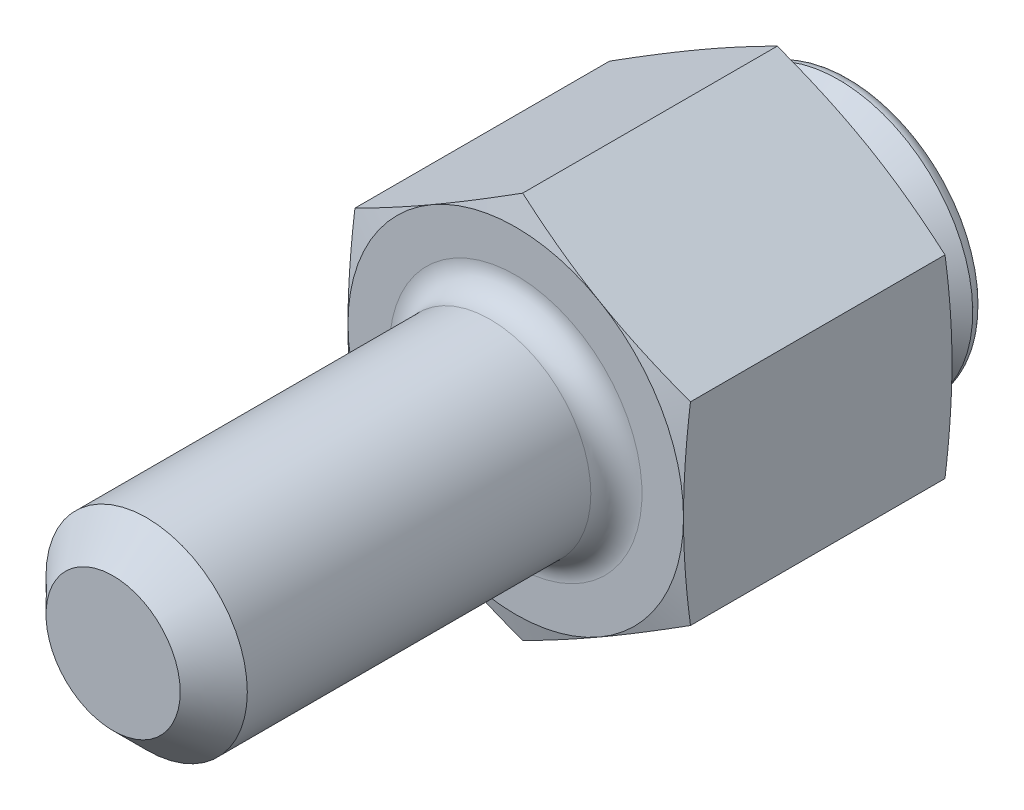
ISO-10303-21;
HEADER;
FILE_DESCRIPTION(('STEP AP214'),'2;1');
FILE_NAME('part.step','',(''),(''),'','','');
FILE_SCHEMA(('AUTOMOTIVE_DESIGN { 1 0 10303 214 1 1 1 1 }'));
ENDSEC;
DATA;
#1=APPLICATION_CONTEXT('core data for automotive mechanical design processes');
#2=APPLICATION_PROTOCOL_DEFINITION('international standard','automotive_design',2000,#1);
#3=PRODUCT_CONTEXT('',#1,'mechanical');
#4=PRODUCT('Part','Part','',(#3));
#5=PRODUCT_RELATED_PRODUCT_CATEGORY('part','',(#4));
#6=PRODUCT_DEFINITION_FORMATION('','',#4);
#7=PRODUCT_DEFINITION_CONTEXT('part definition',#1,'design');
#8=PRODUCT_DEFINITION('design','',#6,#7);
#9=PRODUCT_DEFINITION_SHAPE('','',#8);
#10=(LENGTH_UNIT() NAMED_UNIT(*) SI_UNIT(.MILLI.,.METRE.));
#11=(NAMED_UNIT(*) PLANE_ANGLE_UNIT() SI_UNIT($,.RADIAN.));
#12=(NAMED_UNIT(*) SI_UNIT($,.STERADIAN.) SOLID_ANGLE_UNIT());
#13=UNCERTAINTY_MEASURE_WITH_UNIT(LENGTH_MEASURE(1.E-05),#10,'distance_accuracy_value','');
#14=(GEOMETRIC_REPRESENTATION_CONTEXT(3) GLOBAL_UNCERTAINTY_ASSIGNED_CONTEXT((#13)) GLOBAL_UNIT_ASSIGNED_CONTEXT((#10,
#11,#12)) REPRESENTATION_CONTEXT('',''));
#15=CARTESIAN_POINT('',(0.,0.,0.));
#16=DIRECTION('',(0.,0.,1.));
#17=DIRECTION('',(1.,0.,0.));
#18=AXIS2_PLACEMENT_3D('',#15,#16,#17);
#19=CARTESIAN_POINT('',(0.,0.,4.0013999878));
#20=DIRECTION('',(0.,0.,-1.));
#21=DIRECTION('',(-0.268157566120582,0.963375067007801,0.));
#22=AXIS2_PLACEMENT_3D('',#19,#20,#21);
#23=SPHERICAL_SURFACE('',#22,3.5);
#24=CARTESIAN_POINT('',(0.,0.,2.6349999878));
#25=DIRECTION('',(0.,0.,-1.));
#26=DIRECTION('',(-0.963375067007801,-0.268157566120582,0.));
#27=AXIS2_PLACEMENT_3D('',#24,#25,#26);
#28=CIRCLE('',#27,3.2222586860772);
#29=CARTESIAN_POINT('',(-0.864073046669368,3.1042436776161,2.6349999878));
#30=VERTEX_POINT('',#29);
#31=EDGE_CURVE('E9',#30,#30,#28,.F.);
#32=CARTESIAN_POINT('',(0.,0.,2.25615730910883));
#33=DIRECTION('',(0.,0.,1.));
#34=DIRECTION('',(-0.268157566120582,0.963375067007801,0.));
#35=AXIS2_PLACEMENT_3D('',#32,#33,#34);
#36=CIRCLE('',#35,3.0338305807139);
#37=CARTESIAN_POINT('',(-0.813544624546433,2.92271673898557,2.25615730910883));
#38=VERTEX_POINT('',#37);
#39=EDGE_CURVE('E280',#38,#38,#36,.T.);
#40=CARTESIAN_POINT('',(-0.864073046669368,3.1042436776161,2.6349999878));
#41=CARTESIAN_POINT('',(-0.863611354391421,3.10258501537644,2.63093980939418));
#42=CARTESIAN_POINT('',(-0.863147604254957,3.10091896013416,2.62688288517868));
#43=CARTESIAN_POINT('',(-0.862215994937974,3.09757208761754,2.61877560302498));
#44=CARTESIAN_POINT('',(-0.861748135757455,3.09589127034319,2.61472524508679));
#45=CARTESIAN_POINT('',(-0.860808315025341,3.09251489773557,2.60663115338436));
#46=CARTESIAN_POINT('',(-0.860336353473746,3.0908193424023,2.60258741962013));
#47=CARTESIAN_POINT('',(-0.859388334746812,3.0874135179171,2.59450663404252));
#48=CARTESIAN_POINT('',(-0.858912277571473,3.08570324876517,2.59046958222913));
#49=CARTESIAN_POINT('',(-0.857956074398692,3.08226802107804,2.58240221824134));
#50=CARTESIAN_POINT('',(-0.85747592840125,3.08054306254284,2.57837190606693));
#51=CARTESIAN_POINT('',(-0.856511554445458,3.07707848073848,2.5703180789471));
#52=CARTESIAN_POINT('',(-0.856027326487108,3.07533885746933,2.56629456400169));
#53=CARTESIAN_POINT('',(-0.855054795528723,3.07184497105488,2.55825438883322));
#54=CARTESIAN_POINT('',(-0.854566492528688,3.07009070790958,2.55423772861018));
#55=CARTESIAN_POINT('',(-0.853585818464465,3.0665675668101,2.54621132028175));
#56=CARTESIAN_POINT('',(-0.853093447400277,3.06479868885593,2.54220157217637));
#57=CARTESIAN_POINT('',(-0.852104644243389,3.06124634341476,2.53418904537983));
#58=CARTESIAN_POINT('',(-0.851608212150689,3.05946287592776,2.53018626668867));
#59=CARTESIAN_POINT('',(-0.850611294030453,3.05588137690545,2.52218773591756));
#60=CARTESIAN_POINT('',(-0.850110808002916,3.05408334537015,2.5181919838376));
#61=CARTESIAN_POINT('',(-0.84910578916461,3.05047274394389,2.51020756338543));
#62=CARTESIAN_POINT('',(-0.84860125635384,3.04866017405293,2.50621889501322));
#63=CARTESIAN_POINT('',(-0.847588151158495,3.04502052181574,2.49824869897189));
#64=CARTESIAN_POINT('',(-0.847079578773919,3.0431934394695,2.49426717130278));
#65=CARTESIAN_POINT('',(-0.846058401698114,3.03952478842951,2.48631131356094));
#66=CARTESIAN_POINT('',(-0.845545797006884,3.03768321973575,2.48233698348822));
#67=CARTESIAN_POINT('',(-0.84451656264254,3.03398562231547,2.47439557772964));
#68=CARTESIAN_POINT('',(-0.843999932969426,3.03212959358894,2.47042850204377));
#69=CARTESIAN_POINT('',(-0.842962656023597,3.02840310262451,2.46250166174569));
#70=CARTESIAN_POINT('',(-0.842442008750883,3.0265326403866,2.45854189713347));
#71=CARTESIAN_POINT('',(-0.841396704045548,3.02277730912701,2.450629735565));
#72=CARTESIAN_POINT('',(-0.840872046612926,3.02089244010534,2.44667733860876));
#73=CARTESIAN_POINT('',(-0.839818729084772,3.01710832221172,2.43877996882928));
#74=CARTESIAN_POINT('',(-0.839290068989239,3.01520907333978,2.43483499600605));
#75=CARTESIAN_POINT('',(-0.838228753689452,3.01139622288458,2.42695253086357));
#76=CARTESIAN_POINT('',(-0.837696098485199,3.00948262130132,2.42301503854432));
#77=CARTESIAN_POINT('',(-0.836626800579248,3.00564109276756,2.41514759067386));
#78=CARTESIAN_POINT('',(-0.836090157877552,3.00371316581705,2.41121763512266));
#79=CARTESIAN_POINT('',(-0.835012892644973,2.99984301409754,2.40336531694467));
#80=CARTESIAN_POINT('',(-0.83447227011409,2.99790078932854,2.39944295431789));
#81=CARTESIAN_POINT('',(-0.833387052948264,2.9940020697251,2.39160587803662));
#82=CARTESIAN_POINT('',(-0.832842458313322,2.99204557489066,2.38769116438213));
#83=CARTESIAN_POINT('',(-0.83174930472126,2.98811834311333,2.37986944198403));
#84=CARTESIAN_POINT('',(-0.831200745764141,2.98614760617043,2.37596243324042));
#85=CARTESIAN_POINT('',(-0.830099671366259,2.98219191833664,2.36815617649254));
#86=CARTESIAN_POINT('',(-0.829547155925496,2.98020696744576,2.36425692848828));
#87=CARTESIAN_POINT('',(-0.828438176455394,2.97622288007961,2.3564662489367));
#88=CARTESIAN_POINT('',(-0.827881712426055,2.97422374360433,2.35257481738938));
#89=CARTESIAN_POINT('',(-0.826764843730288,2.97021131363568,2.34479982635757));
#90=CARTESIAN_POINT('',(-0.826204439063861,2.9681980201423,2.34091626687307));
#91=CARTESIAN_POINT('',(-0.825079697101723,2.96415730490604,2.33315707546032));
#92=CARTESIAN_POINT('',(-0.824515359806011,2.96212988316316,2.32928144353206));
#93=CARTESIAN_POINT('',(-0.823382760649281,2.9580609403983,2.32153816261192));
#94=CARTESIAN_POINT('',(-0.822814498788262,2.95601941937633,2.31767051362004));
#95=CARTESIAN_POINT('',(-0.82167405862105,2.95192230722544,2.30994325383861));
#96=CARTESIAN_POINT('',(-0.821101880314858,2.94986671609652,2.30608364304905));
#97=CARTESIAN_POINT('',(-0.819953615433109,2.94574149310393,2.29837251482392));
#98=CARTESIAN_POINT('',(-0.819377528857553,2.94367186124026,2.29452099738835));
#99=CARTESIAN_POINT('',(-0.818221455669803,2.9395185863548,2.28682611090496));
#100=CARTESIAN_POINT('',(-0.817641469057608,2.93743494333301,2.28298274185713));
#101=CARTESIAN_POINT('',(-0.81647760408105,2.93325367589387,2.27530420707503));
#102=CARTESIAN_POINT('',(-0.815893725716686,2.93115605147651,2.27146904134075));
#103=CARTESIAN_POINT('',(-0.814722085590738,2.92694685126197,2.26380696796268));
#104=CARTESIAN_POINT('',(-0.814134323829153,2.92483527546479,2.25998006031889));
#105=CARTESIAN_POINT('',(-0.813544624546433,2.92271673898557,2.25615730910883));
#106=B_SPLINE_CURVE_WITH_KNOTS('',3,(#40,#41,#42,#43,#44,#45,#46,#47,#48,#49,#50,#51,#52,#53,
#54,#55,#56,#57,#58,#59,#60,#61,#62,#63,#64,#65,#66,#67,#68,#69,#70,#71,#72,#73,#74,#75,#76,#77,
#78,#79,#80,#81,#82,#83,#84,#85,#86,#87,#88,#89,#90,#91,#92,#93,#94,#95,#96,#97,#98,#99,#100,
#101,#102,#103,#104,#105),.UNSPECIFIED.,.F.,.F.,(4,2,2,2,2,2,2,2,2,2,2,2,2,2,2,2,2,2,2,2,2,2,2,
2,2,2,2,2,2,2,2,2,4),(0.,0.0132304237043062,0.0264608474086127,0.0396912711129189,
0.0529216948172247,0.0661521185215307,0.0793825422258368,0.0926129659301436,0.10584338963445,
0.119073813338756,0.132304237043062,0.145534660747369,0.158765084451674,0.17199550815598,
0.185225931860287,0.198456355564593,0.211686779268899,0.224917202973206,0.238147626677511,
0.251378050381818,0.264608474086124,0.27783889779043,0.291069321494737,0.304299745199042,
0.317530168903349,0.330760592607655,0.343991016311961,0.357221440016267,0.370451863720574,
0.38368228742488,0.396912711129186,0.410143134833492,0.423373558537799),.UNSPECIFIED.);
#107=EDGE_CURVE('BSEAM14',#30,#38,#106,.T.);
#108=ORIENTED_EDGE('',*,*,#31,.F.);
#109=ORIENTED_EDGE('',*,*,#39,.T.);
#110=ORIENTED_EDGE('',*,*,#107,.T.);
#111=ORIENTED_EDGE('',*,*,#107,.F.);
#112=EDGE_LOOP('',(#108,#110,#109,#111));
#113=FACE_BOUND('',#112,.T.);
#114=ADVANCED_FACE('F14',(#113),#23,.T.);
#115=CARTESIAN_POINT('',(0.,0.,0.));
#116=DIRECTION('',(0.,0.,-1.));
#117=DIRECTION('',(0.268157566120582,-0.963375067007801,0.));
#118=AXIS2_PLACEMENT_3D('',#115,#116,#117);
#119=CYLINDRICAL_SURFACE('',#118,3.);
#120=CARTESIAN_POINT('',(0.,0.,2.12950255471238));
#121=DIRECTION('',(0.,0.,1.));
#122=DIRECTION('',(-0.268157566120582,0.963375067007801,0.));
#123=AXIS2_PLACEMENT_3D('',#120,#121,#122);
#124=CIRCLE('',#123,3.);
#125=CARTESIAN_POINT('',(-0.804472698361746,2.8901252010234,2.12950255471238));
#126=VERTEX_POINT('',#125);
#127=EDGE_CURVE('E278',#126,#126,#124,.F.);
#128=ORIENTED_EDGE('',*,*,#127,.T.);
#129=EDGE_LOOP('',(#128));
#130=FACE_BOUND('',#129,.T.);
#131=CARTESIAN_POINT('',(0.,0.,1.48621024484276));
#132=DIRECTION('',(0.,0.,-1.));
#133=DIRECTION('',(0.268157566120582,-0.963375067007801,0.));
#134=AXIS2_PLACEMENT_3D('',#131,#132,#133);
#135=CIRCLE('',#134,3.);
#136=CARTESIAN_POINT('',(0.804472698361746,-2.8901252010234,1.48621024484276));
#137=VERTEX_POINT('',#136);
#138=EDGE_CURVE('E275',#137,#137,#135,.F.);
#139=ORIENTED_EDGE('',*,*,#138,.T.);
#140=EDGE_LOOP('',(#139));
#141=FACE_BOUND('',#140,.T.);
#142=ADVANCED_FACE('F299',(#130,#141),#119,.T.);
#143=CARTESIAN_POINT('',(0.,0.,1.381));
#144=DIRECTION('',(0.,0.,-1.));
#145=DIRECTION('',(0.268157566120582,-0.963375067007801,0.));
#146=AXIS2_PLACEMENT_3D('',#143,#144,#145);
#147=CONICAL_SURFACE('',#146,3.,0.78539816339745);
#148=CARTESIAN_POINT('',(0.,0.,1.30660512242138));
#149=DIRECTION('',(0.,0.,-1.));
#150=DIRECTION('',(0.268157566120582,-0.963375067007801,0.));
#151=AXIS2_PLACEMENT_3D('',#148,#149,#150);
#152=CIRCLE('',#151,3.07439487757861);
#153=CARTESIAN_POINT('',(0.824422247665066,-2.96179537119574,1.30660512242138));
#154=VERTEX_POINT('',#153);
#155=EDGE_CURVE('E18',#154,#154,#152,.T.);
#156=ORIENTED_EDGE('',*,*,#155,.T.);
#157=EDGE_LOOP('',(#156));
#158=FACE_BOUND('',#157,.T.);
#159=CARTESIAN_POINT('',(0.,0.,0.381));
#160=DIRECTION('',(0.,0.,-1.));
#161=DIRECTION('',(0.268157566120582,-0.963375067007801,0.));
#162=AXIS2_PLACEMENT_3D('',#159,#160,#161);
#163=CIRCLE('',#162,4.);
#164=CARTESIAN_POINT('',(1.07263026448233,-3.8535002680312,0.381));
#165=VERTEX_POINT('',#164);
#166=EDGE_CURVE('E269',#165,#165,#163,.T.);
#167=ORIENTED_EDGE('',*,*,#166,.F.);
#168=EDGE_LOOP('',(#167));
#169=FACE_BOUND('',#168,.T.);
#170=ADVANCED_FACE('F305',(#158,#169),#147,.T.);
#171=CARTESIAN_POINT('',(-1.07263026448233,3.85350026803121,0.));
#172=DIRECTION('',(0.,0.,1.));
#173=DIRECTION('',(-0.268157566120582,0.963375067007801,0.));
#174=AXIS2_PLACEMENT_3D('',#171,#172,#173);
#175=PLANE('',#174);
#176=CARTESIAN_POINT('',(0.,0.,0.));
#177=DIRECTION('',(0.,0.,1.));
#178=DIRECTION('',(-0.268157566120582,0.963375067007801,0.));
#179=AXIS2_PLACEMENT_3D('',#176,#177,#178);
#180=CIRCLE('',#179,3.619);
#181=CARTESIAN_POINT('',(-0.970462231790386,3.48645436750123,0.));
#182=VERTEX_POINT('',#181);
#183=EDGE_CURVE('E272',#182,#182,#180,.F.);
#184=ORIENTED_EDGE('',*,*,#183,.T.);
#185=EDGE_LOOP('',(#184));
#186=FACE_BOUND('',#185,.T.);
#187=ADVANCED_FACE('F347',(#186),#175,.F.);
#188=CARTESIAN_POINT('',(0.,0.,0.381));
#189=DIRECTION('',(0.,0.,1.));
#190=DIRECTION('',(-0.268157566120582,0.963375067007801,0.));
#191=AXIS2_PLACEMENT_3D('',#188,#189,#190);
#192=TOROIDAL_SURFACE('',#191,3.619,0.381);
#193=ORIENTED_EDGE('',*,*,#166,.T.);
#194=EDGE_LOOP('',(#193));
#195=FACE_BOUND('',#194,.T.);
#196=ORIENTED_EDGE('',*,*,#183,.F.);
#197=EDGE_LOOP('',(#196));
#198=FACE_BOUND('',#197,.T.);
#199=ADVANCED_FACE('F350',(#195,#198),#192,.T.);
#200=CARTESIAN_POINT('',(0.,0.,2.12950255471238));
#201=DIRECTION('',(0.,0.,1.));
#202=DIRECTION('',(-0.268157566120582,0.963375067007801,0.));
#203=AXIS2_PLACEMENT_3D('',#200,#201,#202);
#204=TOROIDAL_SURFACE('',#203,3.254,0.254);
#205=ORIENTED_EDGE('',*,*,#39,.F.);
#206=EDGE_LOOP('',(#205));
#207=FACE_BOUND('',#206,.T.);
#208=ORIENTED_EDGE('',*,*,#127,.F.);
#209=EDGE_LOOP('',(#208));
#210=FACE_BOUND('',#209,.T.);
#211=ADVANCED_FACE('F321',(#207,#210),#204,.F.);
#212=CARTESIAN_POINT('',(0.,0.,1.48621024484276));
#213=DIRECTION('',(0.,0.,-1.));
#214=DIRECTION('',(0.268157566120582,-0.963375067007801,0.));
#215=AXIS2_PLACEMENT_3D('',#212,#213,#214);
#216=TOROIDAL_SURFACE('',#215,3.254,0.254);
#217=ORIENTED_EDGE('',*,*,#138,.F.);
#218=EDGE_LOOP('',(#217));
#219=FACE_BOUND('',#218,.T.);
#220=ORIENTED_EDGE('',*,*,#155,.F.);
#221=EDGE_LOOP('',(#220));
#222=FACE_BOUND('',#221,.T.);
#223=ADVANCED_FACE('F16',(#219,#222),#216,.F.);
#224=CARTESIAN_POINT('',(0.,0.,21.9999999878));
#225=DIRECTION('',(0.,0.,1.));
#226=DIRECTION('',(1.,0.,0.));
#227=AXIS2_PLACEMENT_3D('',#224,#225,#226);
#228=PLANE('',#227);
#229=CARTESIAN_POINT('',(0.,0.,21.9999999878));
#230=DIRECTION('',(0.,0.,1.));
#231=DIRECTION('',(1.,0.,0.));
#232=AXIS2_PLACEMENT_3D('',#229,#230,#231);
#233=CIRCLE('',#232,2.);
#234=CARTESIAN_POINT('',(2.,0.,21.9999999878));
#235=VERTEX_POINT('',#234);
#236=EDGE_CURVE('E264',#235,#235,#233,.T.);
#237=ORIENTED_EDGE('',*,*,#236,.T.);
#238=EDGE_LOOP('',(#237));
#239=FACE_BOUND('',#238,.T.);
#240=ADVANCED_FACE('F309',(#239),#228,.T.);
#241=CARTESIAN_POINT('',(0.,0.,21.9999999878));
#242=DIRECTION('',(0.,0.,-1.));
#243=DIRECTION('',(-1.,0.,0.));
#244=AXIS2_PLACEMENT_3D('',#241,#242,#243);
#245=CONICAL_SURFACE('',#244,2.,0.785398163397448);
#246=CARTESIAN_POINT('',(0.,0.,20.9999999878));
#247=DIRECTION('',(0.,0.,1.));
#248=DIRECTION('',(1.,0.,0.));
#249=AXIS2_PLACEMENT_3D('',#246,#247,#248);
#250=CIRCLE('',#249,3.);
#251=CARTESIAN_POINT('',(3.,0.,20.9999999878));
#252=VERTEX_POINT('',#251);
#253=EDGE_CURVE('E23',#252,#252,#250,.F.);
#254=ORIENTED_EDGE('',*,*,#253,.F.);
#255=EDGE_LOOP('',(#254));
#256=FACE_BOUND('',#255,.T.);
#257=ORIENTED_EDGE('',*,*,#236,.F.);
#258=EDGE_LOOP('',(#257));
#259=FACE_BOUND('',#258,.T.);
#260=ADVANCED_FACE('F311',(#256,#259),#245,.T.);
#261=CARTESIAN_POINT('',(0.,0.,21.9999999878));
#262=DIRECTION('',(0.,0.,-1.));
#263=DIRECTION('',(-1.,0.,0.));
#264=AXIS2_PLACEMENT_3D('',#261,#262,#263);
#265=CYLINDRICAL_SURFACE('',#264,3.);
#266=ORIENTED_EDGE('',*,*,#253,.T.);
#267=EDGE_LOOP('',(#266));
#268=FACE_BOUND('',#267,.T.);
#269=CARTESIAN_POINT('',(0.,0.,10.7619999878));
#270=DIRECTION('',(0.,0.,-1.));
#271=DIRECTION('',(-1.,0.,0.));
#272=AXIS2_PLACEMENT_3D('',#269,#270,#271);
#273=CIRCLE('',#272,3.);
#274=CARTESIAN_POINT('',(-3.,0.,10.7619999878));
#275=VERTEX_POINT('',#274);
#276=EDGE_CURVE('E258',#275,#275,#273,.F.);
#277=ORIENTED_EDGE('',*,*,#276,.T.);
#278=EDGE_LOOP('',(#277));
#279=FACE_BOUND('',#278,.T.);
#280=ADVANCED_FACE('F318',(#268,#279),#265,.T.);
#281=CARTESIAN_POINT('',(0.,0.,10.7619999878));
#282=DIRECTION('',(0.,0.,-1.));
#283=DIRECTION('',(-1.,0.,0.));
#284=AXIS2_PLACEMENT_3D('',#281,#282,#283);
#285=TOROIDAL_SURFACE('',#284,3.762,0.762);
#286=CARTESIAN_POINT('',(0.,0.,9.9999999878));
#287=DIRECTION('',(0.,0.,-1.));
#288=DIRECTION('',(-1.,0.,0.));
#289=AXIS2_PLACEMENT_3D('',#286,#287,#288);
#290=CIRCLE('',#289,3.762);
#291=CARTESIAN_POINT('',(-3.762,0.,9.9999999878));
#292=VERTEX_POINT('',#291);
#293=EDGE_CURVE('E261',#292,#292,#290,.T.);
#294=ORIENTED_EDGE('',*,*,#293,.F.);
#295=EDGE_LOOP('',(#294));
#296=FACE_BOUND('',#295,.T.);
#297=ORIENTED_EDGE('',*,*,#276,.F.);
#298=EDGE_LOOP('',(#297));
#299=FACE_BOUND('',#298,.T.);
#300=ADVANCED_FACE('F324',(#296,#299),#285,.F.);
#301=CARTESIAN_POINT('',(-5.,8.66025403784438,9.9999999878));
#302=DIRECTION('',(0.,0.,-1.));
#303=DIRECTION('',(-1.,0.,0.));
#304=AXIS2_PLACEMENT_3D('',#301,#302,#303);
#305=PLANE('',#304);
#306=CARTESIAN_POINT('',(0.,0.,9.9999999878));
#307=DIRECTION('',(0.,0.,-1.));
#308=DIRECTION('',(-1.,0.,0.));
#309=AXIS2_PLACEMENT_3D('',#306,#307,#308);
#310=CIRCLE('',#309,5.);
#311=CARTESIAN_POINT('',(-5.,0.,9.9999999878));
#312=VERTEX_POINT('',#311);
#313=CARTESIAN_POINT('',(-2.5,4.33012701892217,9.9999999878));
#314=VERTEX_POINT('',#313);
#315=EDGE_CURVE('E624',#312,#314,#310,.T.);
#316=ORIENTED_EDGE('',*,*,#315,.F.);
#317=CARTESIAN_POINT('',(0.,0.,9.9999999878));
#318=DIRECTION('',(0.,0.,-1.));
#319=DIRECTION('',(-1.,0.,0.));
#320=AXIS2_PLACEMENT_3D('',#317,#318,#319);
#321=CIRCLE('',#320,5.);
#322=CARTESIAN_POINT('',(-2.5,-4.33012701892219,9.9999999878));
#323=VERTEX_POINT('',#322);
#324=EDGE_CURVE('E235',#323,#312,#321,.T.);
#325=ORIENTED_EDGE('',*,*,#324,.F.);
#326=CARTESIAN_POINT('',(2.5,-4.33012701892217,9.9999999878));
#327=VERTEX_POINT('',#326);
#328=EDGE_CURVE('E249',#327,#323,#321,.T.);
#329=ORIENTED_EDGE('',*,*,#328,.F.);
#330=CARTESIAN_POINT('',(5.,0.,9.9999999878));
#331=VERTEX_POINT('',#330);
#332=EDGE_CURVE('E670',#331,#327,#321,.T.);
#333=ORIENTED_EDGE('',*,*,#332,.F.);
#334=CARTESIAN_POINT('',(2.5,4.33012701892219,9.9999999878));
#335=VERTEX_POINT('',#334);
#336=EDGE_CURVE('E672',#335,#331,#321,.T.);
#337=ORIENTED_EDGE('',*,*,#336,.F.);
#338=EDGE_CURVE('E250',#314,#335,#321,.T.);
#339=ORIENTED_EDGE('',*,*,#338,.F.);
#340=EDGE_LOOP('',(#316,#325,#329,#333,#337,#339));
#341=FACE_BOUND('',#340,.T.);
#342=ORIENTED_EDGE('',*,*,#293,.T.);
#343=EDGE_LOOP('',(#342));
#344=FACE_BOUND('',#343,.T.);
#345=ADVANCED_FACE('F329',(#341,#344),#305,.F.);
#346=CARTESIAN_POINT('',(0.,0.,8.58583630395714));
#347=DIRECTION('',(0.,0.,-1.));
#348=DIRECTION('',(-1.,0.,0.));
#349=AXIS2_PLACEMENT_3D('',#346,#347,#348);
#350=CONICAL_SURFACE('',#349,10.2777307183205,1.30899693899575);
#351=CARTESIAN_POINT('',(5.,-7.71939307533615,8.87535574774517));
#352=CARTESIAN_POINT('',(5.00000000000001,-7.49157817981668,8.92657651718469));
#353=CARTESIAN_POINT('',(5.00000000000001,-7.26362305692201,8.97718453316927));
#354=CARTESIAN_POINT('',(5.00000000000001,-6.80736329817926,9.07684412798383));
#355=CARTESIAN_POINT('',(5.00000000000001,-6.57905864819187,9.1258956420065));
#356=CARTESIAN_POINT('',(5.00000000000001,-6.12183892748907,9.222151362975));
#357=CARTESIAN_POINT('',(5.00000000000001,-5.89292348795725,9.26935382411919));
#358=CARTESIAN_POINT('',(5.00000000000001,-5.43462208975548,9.36141523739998));
#359=CARTESIAN_POINT('',(5.00000000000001,-5.20523613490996,9.40627420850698));
#360=CARTESIAN_POINT('',(5.00000000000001,-4.74777405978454,9.49273650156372));
#361=CARTESIAN_POINT('',(5.00000000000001,-4.51970239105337,9.53436326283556));
#362=CARTESIAN_POINT('',(5.00000000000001,-4.06294165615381,9.61407288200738));
#363=CARTESIAN_POINT('',(5.00000000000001,-3.83425260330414,9.65215581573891));
#364=CARTESIAN_POINT('',(5.00000000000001,-3.37620199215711,9.72393812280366));
#365=CARTESIAN_POINT('',(5.00000000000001,-3.14684049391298,9.75763787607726));
#366=CARTESIAN_POINT('',(5.00000000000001,-2.68738519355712,9.81967591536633));
#367=CARTESIAN_POINT('',(5.,-2.4572913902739,9.84801419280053));
#368=CARTESIAN_POINT('',(5.,-1.99373595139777,9.89854595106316));
#369=CARTESIAN_POINT('',(5.,-1.76026606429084,9.92066484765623));
#370=CARTESIAN_POINT('',(5.00000000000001,-1.29272172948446,9.95724257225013));
#371=CARTESIAN_POINT('',(5.00000000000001,-1.05864729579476,9.9717015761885));
#372=CARTESIAN_POINT('',(5.,-0.590237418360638,9.99211738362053));
#373=CARTESIAN_POINT('',(5.,-0.355902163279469,9.99807842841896));
#374=CARTESIAN_POINT('',(5.,0.112826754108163,10.0011300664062));
#375=CARTESIAN_POINT('',(5.,0.347220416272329,9.99822068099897));
#376=CARTESIAN_POINT('',(5.,0.816634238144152,9.98369271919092));
#377=CARTESIAN_POINT('',(5.,1.05165334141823,9.97204069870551));
#378=CARTESIAN_POINT('',(5.,1.52115001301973,9.94069812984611));
#379=CARTESIAN_POINT('',(5.,1.7556275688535,9.92100739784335));
#380=CARTESIAN_POINT('',(5.,2.22403930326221,9.87460237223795));
#381=CARTESIAN_POINT('',(5.,2.45797299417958,9.84788323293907));
#382=CARTESIAN_POINT('',(5.,2.92508386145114,9.78855862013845));
#383=CARTESIAN_POINT('',(5.,3.15826103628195,9.75595313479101));
#384=CARTESIAN_POINT('',(5.,3.6242567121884,9.68586811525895));
#385=CARTESIAN_POINT('',(5.,3.85707404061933,9.64838085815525));
#386=CARTESIAN_POINT('',(5.,4.32204975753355,9.56950129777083));
#387=CARTESIAN_POINT('',(5.,4.55420812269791,9.5281088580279));
#388=CARTESIAN_POINT('',(5.,5.01796734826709,9.44218275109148));
#389=CARTESIAN_POINT('',(5.,5.24956814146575,9.39764872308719));
#390=CARTESIAN_POINT('',(5.,5.71227051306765,9.30605222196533));
#391=CARTESIAN_POINT('',(5.,5.94337208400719,9.2589897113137));
#392=CARTESIAN_POINT('',(4.99999999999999,6.63618971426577,9.11473521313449));
#393=CARTESIAN_POINT('',(4.99999999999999,7.09727206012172,9.01450411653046));
#394=CARTESIAN_POINT('',(4.99999999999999,8.01819214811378,8.80869227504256));
#395=CARTESIAN_POINT('',(4.99999999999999,8.47802997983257,8.703111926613));
#396=CARTESIAN_POINT('',(4.99999999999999,9.39186405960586,8.48941702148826));
#397=CARTESIAN_POINT('',(4.99999999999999,9.84586964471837,8.38134228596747));
#398=CARTESIAN_POINT('',(4.99999999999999,10.7532680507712,8.16261349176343));
#399=CARTESIAN_POINT('',(4.99999999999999,11.2066608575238,8.05195937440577));
#400=CARTESIAN_POINT('',(4.99999999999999,12.112331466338,7.82893014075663));
#401=CARTESIAN_POINT('',(4.99999999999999,12.5646099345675,7.71655772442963));
#402=CARTESIAN_POINT('',(4.99999999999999,13.4687908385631,7.49037953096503));
#403=CARTESIAN_POINT('',(4.99999999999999,13.9206932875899,7.37657380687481));
#404=CARTESIAN_POINT('',(5.,14.3724678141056,7.26226851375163));
#405=B_SPLINE_CURVE_WITH_KNOTS('',3,(#351,#352,#353,#354,#355,#356,#357,#358,#359,#360,#361,
#362,#363,#364,#365,#366,#367,#368,#369,#370,#371,#372,#373,#374,#375,#376,#377,#378,#379,#380,
#381,#382,#383,#384,#385,#386,#387,#388,#389,#390,#391,#392,#393,#394,#395,#396,#397,#398,#399,
#400,#401,#402,#403,#404),.UNSPECIFIED.,.F.,.F.,(4,2,2,2,2,2,2,2,2,2,2,2,2,2,2,2,2,2,2,2,2,2,2,
2,2,2,4),(0.,0.700508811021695,1.40104675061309,2.10223090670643,2.80340938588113,
3.49890505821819,4.19438584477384,4.88980630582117,5.58522787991,6.28866433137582,
6.99208462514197,7.69515372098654,8.39822112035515,9.10399183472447,9.8097786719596,
10.5160533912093,11.2223295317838,11.9297368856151,12.6371689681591,13.3446824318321,
14.0522064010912,15.4677020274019,16.883092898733,18.283157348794,19.6832536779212,
21.0813391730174,22.4793730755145),.UNSPECIFIED.);
#406=CARTESIAN_POINT('',(5.,-2.88675134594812,9.79274056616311));
#407=VERTEX_POINT('',#406);
#408=EDGE_CURVE('E231',#331,#407,#405,.F.);
#409=ORIENTED_EDGE('',*,*,#408,.F.);
#410=ORIENTED_EDGE('',*,*,#332,.T.);
#411=CARTESIAN_POINT('',(5.0002,-2.88663587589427,9.79270962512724));
#412=CARTESIAN_POINT('',(4.79254599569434,-3.00652497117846,9.824847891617));
#413=CARTESIAN_POINT('',(4.58451548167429,-3.12663144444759,9.85402417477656));
#414=CARTESIAN_POINT('',(4.16771975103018,-3.36726857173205,9.90528421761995));
#415=CARTESIAN_POINT('',(3.95895427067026,-3.48779937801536,9.92736509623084));
#416=CARTESIAN_POINT('',(3.54195440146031,-3.72855436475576,9.96314521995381));
#417=CARTESIAN_POINT('',(3.33372283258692,-3.84877691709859,9.97688713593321));
#418=CARTESIAN_POINT('',(2.91699413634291,-4.08937534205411,9.99531364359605));
#419=CARTESIAN_POINT('',(2.70849706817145,-4.20975118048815,9.9999999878));
#420=CARTESIAN_POINT('',(2.29150293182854,-4.45050285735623,9.9999999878));
#421=CARTESIAN_POINT('',(2.08300586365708,-4.57087869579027,9.99531364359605));
#422=CARTESIAN_POINT('',(1.66627716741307,-4.81147712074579,9.97688713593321));
#423=CARTESIAN_POINT('',(1.45804559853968,-4.93169967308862,9.9631452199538));
#424=CARTESIAN_POINT('',(1.04104572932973,-5.17245465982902,9.92736509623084));
#425=CARTESIAN_POINT('',(0.832280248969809,-5.29298546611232,9.90528421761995));
#426=CARTESIAN_POINT('',(0.415484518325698,-5.53362259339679,9.85402417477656));
#427=CARTESIAN_POINT('',(0.207454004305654,-5.65372906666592,9.824847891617));
#428=CARTESIAN_POINT('',(-0.000200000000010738,-5.7736181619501,9.79270962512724));
#429=B_SPLINE_CURVE_WITH_KNOTS('',3,(#411,#412,#413,#414,#415,#416,#417,#418,#419,#420,#421,
#422,#423,#424,#425,#426,#427,#428),.UNSPECIFIED.,.F.,.F.,(4,2,2,2,2,2,2,2,4),(0.,
0.72580523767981,1.45190481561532,2.17425686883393,2.89646911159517,3.61868135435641,
4.34103340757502,5.06713298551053,5.79293822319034),.UNSPECIFIED.);
#430=EDGE_CURVE('E230',#407,#327,#429,.T.);
#431=ORIENTED_EDGE('',*,*,#430,.F.);
#432=EDGE_LOOP('',(#409,#410,#431));
#433=FACE_BOUND('',#432,.T.);
#434=ADVANCED_FACE('F341',(#433),#350,.T.);
#435=CARTESIAN_POINT('',(-0.000200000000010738,5.7736181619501,9.79270962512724));
#436=CARTESIAN_POINT('',(0.207454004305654,5.65372906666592,9.824847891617));
#437=CARTESIAN_POINT('',(0.415484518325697,5.53362259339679,9.85402417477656));
#438=CARTESIAN_POINT('',(0.832280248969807,5.29298546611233,9.90528421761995));
#439=CARTESIAN_POINT('',(1.04104572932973,5.17245465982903,9.92736509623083));
#440=CARTESIAN_POINT('',(1.45804559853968,4.93169967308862,9.9631452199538));
#441=CARTESIAN_POINT('',(1.66627716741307,4.81147712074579,9.97688713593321));
#442=CARTESIAN_POINT('',(2.08300586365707,4.57087869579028,9.99531364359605));
#443=CARTESIAN_POINT('',(2.29150293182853,4.45050285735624,9.9999999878));
#444=CARTESIAN_POINT('',(2.70849706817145,4.20975118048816,9.9999999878));
#445=CARTESIAN_POINT('',(2.9169941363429,4.08937534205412,9.99531364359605));
#446=CARTESIAN_POINT('',(3.33372283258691,3.8487769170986,9.97688713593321));
#447=CARTESIAN_POINT('',(3.5419544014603,3.72855436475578,9.9631452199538));
#448=CARTESIAN_POINT('',(3.95895427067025,3.48779937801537,9.92736509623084));
#449=CARTESIAN_POINT('',(4.16771975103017,3.36726857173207,9.90528421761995));
#450=CARTESIAN_POINT('',(4.58451548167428,3.12663144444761,9.85402417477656));
#451=CARTESIAN_POINT('',(4.79254599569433,3.00652497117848,9.824847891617));
#452=CARTESIAN_POINT('',(5.0002,2.88663587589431,9.79270962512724));
#453=B_SPLINE_CURVE_WITH_KNOTS('',3,(#435,#436,#437,#438,#439,#440,#441,#442,#443,#444,#445,
#446,#447,#448,#449,#450,#451,#452),.UNSPECIFIED.,.F.,.F.,(4,2,2,2,2,2,2,2,4),(0.,
0.725805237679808,1.45190481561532,2.17425686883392,2.89646911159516,3.6186813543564,
4.341033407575,5.06713298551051,5.79293822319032),.UNSPECIFIED.);
#454=CARTESIAN_POINT('',(5.,2.88675134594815,9.7927405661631));
#455=VERTEX_POINT('',#454);
#456=EDGE_CURVE('E643',#335,#455,#453,.T.);
#457=ORIENTED_EDGE('',*,*,#456,.F.);
#458=ORIENTED_EDGE('',*,*,#336,.T.);
#459=EDGE_CURVE('E217',#455,#331,#405,.F.);
#460=ORIENTED_EDGE('',*,*,#459,.F.);
#461=EDGE_LOOP('',(#457,#458,#460));
#462=FACE_BOUND('',#461,.T.);
#463=ADVANCED_FACE('F418',(#462),#350,.T.);
#464=CARTESIAN_POINT('',(-5.0002,2.88663587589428,9.79270962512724));
#465=CARTESIAN_POINT('',(-4.79254599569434,3.00652497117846,9.824847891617));
#466=CARTESIAN_POINT('',(-4.58451548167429,3.12663144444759,9.85402417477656));
#467=CARTESIAN_POINT('',(-4.16771975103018,3.36726857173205,9.90528421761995));
#468=CARTESIAN_POINT('',(-3.95895427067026,3.48779937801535,9.92736509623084));
#469=CARTESIAN_POINT('',(-3.54195440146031,3.72855436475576,9.9631452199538));
#470=CARTESIAN_POINT('',(-3.33372283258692,3.84877691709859,9.97688713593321));
#471=CARTESIAN_POINT('',(-2.91699413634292,4.08937534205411,9.99531364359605));
#472=CARTESIAN_POINT('',(-2.70849706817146,4.20975118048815,9.9999999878));
#473=CARTESIAN_POINT('',(-2.29150293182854,4.45050285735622,9.9999999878));
#474=CARTESIAN_POINT('',(-2.08300586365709,4.57087869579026,9.99531364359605));
#475=CARTESIAN_POINT('',(-1.66627716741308,4.81147712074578,9.97688713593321));
#476=CARTESIAN_POINT('',(-1.45804559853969,4.93169967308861,9.96314521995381));
#477=CARTESIAN_POINT('',(-1.04104572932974,5.17245465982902,9.92736509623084));
#478=CARTESIAN_POINT('',(-0.83228024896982,5.29298546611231,9.90528421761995));
#479=CARTESIAN_POINT('',(-0.415484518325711,5.53362259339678,9.85402417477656));
#480=CARTESIAN_POINT('',(-0.207454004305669,5.65372906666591,9.824847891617));
#481=CARTESIAN_POINT('',(0.00019999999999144,5.7736181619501,9.79270962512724));
#482=B_SPLINE_CURVE_WITH_KNOTS('',3,(#464,#465,#466,#467,#468,#469,#470,#471,#472,#473,#474,
#475,#476,#477,#478,#479,#480,#481),.UNSPECIFIED.,.F.,.F.,(4,2,2,2,2,2,2,2,4),(0.,
0.725805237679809,1.45190481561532,2.17425686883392,2.89646911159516,3.6186813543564,
4.341033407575,5.06713298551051,5.79293822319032),.UNSPECIFIED.);
#483=CARTESIAN_POINT('',(0.,5.77350269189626,9.7927405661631));
#484=VERTEX_POINT('',#483);
#485=EDGE_CURVE('E626',#314,#484,#482,.T.);
#486=ORIENTED_EDGE('',*,*,#485,.F.);
#487=ORIENTED_EDGE('',*,*,#338,.T.);
#488=EDGE_CURVE('E636',#484,#335,#453,.T.);
#489=ORIENTED_EDGE('',*,*,#488,.F.);
#490=EDGE_LOOP('',(#486,#487,#489));
#491=FACE_BOUND('',#490,.T.);
#492=ADVANCED_FACE('F159',(#491),#350,.T.);
#493=ORIENTED_EDGE('',*,*,#315,.T.);
#494=CARTESIAN_POINT('',(-5.,2.88675134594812,9.7927405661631));
#495=VERTEX_POINT('',#494);
#496=EDGE_CURVE('E629',#495,#314,#482,.T.);
#497=ORIENTED_EDGE('',*,*,#496,.F.);
#498=CARTESIAN_POINT('',(-5.,-7.71939307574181,8.87535574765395));
#499=CARTESIAN_POINT('',(-5.,-7.49157818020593,8.92657651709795));
#500=CARTESIAN_POINT('',(-4.99999999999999,-7.26362305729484,8.97718453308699));
#501=CARTESIAN_POINT('',(-4.99999999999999,-6.80736329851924,9.07684412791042));
#502=CARTESIAN_POINT('',(-4.99999999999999,-6.57905864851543,9.1258956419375));
#503=CARTESIAN_POINT('',(-5.,-6.12183892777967,9.22215136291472));
#504=CARTESIAN_POINT('',(-5.,-5.89292348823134,9.26935382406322));
#505=CARTESIAN_POINT('',(-5.,-5.4346220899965,9.36141523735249));
#506=CARTESIAN_POINT('',(-5.,-5.20523613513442,9.40627420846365));
#507=CARTESIAN_POINT('',(-5.,-4.74777405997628,9.49273650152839));
#508=CARTESIAN_POINT('',(-5.,-4.51970239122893,9.53436326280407));
#509=CARTESIAN_POINT('',(-5.,-4.06294165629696,9.61407288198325));
#510=CARTESIAN_POINT('',(-5.,-3.83425260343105,9.6521558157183));
#511=CARTESIAN_POINT('',(-5.,-3.37620199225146,9.7239381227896));
#512=CARTESIAN_POINT('',(-5.,-3.146840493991,9.75763787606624));
#513=CARTESIAN_POINT('',(-5.,-2.68738519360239,9.81967591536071));
#514=CARTESIAN_POINT('',(-5.,-2.45729139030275,9.84801419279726));
#515=CARTESIAN_POINT('',(-5.,-1.9937359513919,9.89854595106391));
#516=CARTESIAN_POINT('',(-5.,-1.76026606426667,9.92066484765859));
#517=CARTESIAN_POINT('',(-5.,-1.29272172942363,9.95724257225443));
#518=CARTESIAN_POINT('',(-5.,-1.05864729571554,9.97170157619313));
#519=CARTESIAN_POINT('',(-5.,-0.59023741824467,9.99211738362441));
#520=CARTESIAN_POINT('',(-5.,-0.355902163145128,9.99807842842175));
#521=CARTESIAN_POINT('',(-5.,0.112826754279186,10.0011300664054));
#522=CARTESIAN_POINT('',(-5.,0.347220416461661,9.99822068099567));
#523=CARTESIAN_POINT('',(-5.,0.816634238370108,9.98369271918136));
#524=CARTESIAN_POINT('',(-5.00000000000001,1.0516533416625,9.9720406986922));
#525=CARTESIAN_POINT('',(-5.00000000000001,1.52115001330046,9.94069812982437));
#526=CARTESIAN_POINT('',(-5.00000000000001,1.75562756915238,9.92100739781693));
#527=CARTESIAN_POINT('',(-5.00000000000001,2.22403930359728,9.87460237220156));
#528=CARTESIAN_POINT('',(-5.00000000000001,2.45797299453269,9.84788323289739));
#529=CARTESIAN_POINT('',(-5.00000000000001,2.9250838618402,9.78855862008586));
#530=CARTESIAN_POINT('',(-5.,3.15826103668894,9.75595313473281));
#531=CARTESIAN_POINT('',(-5.,3.62425671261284,9.6858681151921));
#532=CARTESIAN_POINT('',(-5.00000000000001,3.85707404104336,9.64838085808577));
#533=CARTESIAN_POINT('',(-5.00000000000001,4.32204975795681,9.56950129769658));
#534=CARTESIAN_POINT('',(-5.00000000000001,4.5542081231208,9.52810885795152));
#535=CARTESIAN_POINT('',(-5.00000000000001,5.0179673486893,9.44218275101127));
#536=CARTESIAN_POINT('',(-5.00000000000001,5.24956814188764,9.39764872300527));
#537=CARTESIAN_POINT('',(-5.00000000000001,5.71227051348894,9.30605222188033));
#538=CARTESIAN_POINT('',(-5.00000000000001,5.94337208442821,9.25898971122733));
#539=CARTESIAN_POINT('',(-5.00000000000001,6.63618971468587,9.11473521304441));
#540=CARTESIAN_POINT('',(-5.00000000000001,7.09727206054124,9.01450411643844));
#541=CARTESIAN_POINT('',(-5.00000000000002,8.01819214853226,8.8086922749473));
#542=CARTESIAN_POINT('',(-5.00000000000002,8.47802998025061,8.70311192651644));
#543=CARTESIAN_POINT('',(-5.00000000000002,9.39186406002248,8.48941702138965));
#544=CARTESIAN_POINT('',(-5.00000000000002,9.84586964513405,8.38134228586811));
#545=CARTESIAN_POINT('',(-5.00000000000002,10.7532680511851,8.16261349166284));
#546=CARTESIAN_POINT('',(-5.00000000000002,11.2066608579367,8.0519593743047));
#547=CARTESIAN_POINT('',(-5.00000000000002,12.1123314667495,7.82893014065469));
#548=CARTESIAN_POINT('',(-5.00000000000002,12.5646099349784,7.71655772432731));
#549=CARTESIAN_POINT('',(-5.00000000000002,13.4687908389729,7.49037953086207));
#550=CARTESIAN_POINT('',(-5.00000000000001,13.9206932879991,7.37657380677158));
#551=CARTESIAN_POINT('',(-5.,14.3724678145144,7.26226851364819));
#552=B_SPLINE_CURVE_WITH_KNOTS('',3,(#498,#499,#500,#501,#502,#503,#504,#505,#506,#507,#508,
#509,#510,#511,#512,#513,#514,#515,#516,#517,#518,#519,#520,#521,#522,#523,#524,#525,#526,#527,
#528,#529,#530,#531,#532,#533,#534,#535,#536,#537,#538,#539,#540,#541,#542,#543,#544,#545,#546,
#547,#548,#549,#550,#551),.UNSPECIFIED.,.F.,.F.,(4,2,2,2,2,2,2,2,2,2,2,2,2,2,2,2,2,2,2,2,2,2,2,
2,2,2,4),(0.,0.700508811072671,1.40104675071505,2.10223090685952,2.80340938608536,
3.49890505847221,4.19438584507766,4.88980630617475,5.58522788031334,6.28866433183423,
6.99208462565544,7.69515372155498,8.39822112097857,9.1039918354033,9.80977867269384,
10.5160533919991,11.2223295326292,11.9297368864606,12.6371689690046,13.3446824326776,
14.0522064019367,15.467702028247,16.8830928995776,18.2831573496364,19.6832536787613,
21.0813391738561,22.4793730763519),.UNSPECIFIED.);
#553=EDGE_CURVE('E642',#312,#495,#552,.T.);
#554=ORIENTED_EDGE('',*,*,#553,.F.);
#555=EDGE_LOOP('',(#493,#497,#554));
#556=FACE_BOUND('',#555,.T.);
#557=ADVANCED_FACE('F429',(#556),#350,.T.);
#558=ORIENTED_EDGE('',*,*,#324,.T.);
#559=CARTESIAN_POINT('',(-5.,-2.88675134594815,9.7927405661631));
#560=VERTEX_POINT('',#559);
#561=EDGE_CURVE('E653',#560,#312,#552,.T.);
#562=ORIENTED_EDGE('',*,*,#561,.F.);
#563=CARTESIAN_POINT('',(0.000199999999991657,-5.7736181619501,9.79270962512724));
#564=CARTESIAN_POINT('',(-0.207454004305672,-5.65372906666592,9.824847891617));
#565=CARTESIAN_POINT('',(-0.415484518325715,-5.53362259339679,9.85402417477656));
#566=CARTESIAN_POINT('',(-0.832280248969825,-5.29298546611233,9.90528421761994));
#567=CARTESIAN_POINT('',(-1.04104572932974,-5.17245465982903,9.92736509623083));
#568=CARTESIAN_POINT('',(-1.4580455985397,-4.93169967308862,9.9631452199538));
#569=CARTESIAN_POINT('',(-1.66627716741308,-4.8114771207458,9.97688713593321));
#570=CARTESIAN_POINT('',(-2.08300586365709,-4.57087869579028,9.99531364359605));
#571=CARTESIAN_POINT('',(-2.29150293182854,-4.45050285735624,9.9999999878));
#572=CARTESIAN_POINT('',(-2.70849706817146,-4.20975118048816,9.9999999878));
#573=CARTESIAN_POINT('',(-2.91699413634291,-4.08937534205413,9.99531364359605));
#574=CARTESIAN_POINT('',(-3.33372283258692,-3.84877691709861,9.97688713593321));
#575=CARTESIAN_POINT('',(-3.54195440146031,-3.72855436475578,9.9631452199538));
#576=CARTESIAN_POINT('',(-3.95895427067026,-3.48779937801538,9.92736509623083));
#577=CARTESIAN_POINT('',(-4.16771975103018,-3.36726857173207,9.90528421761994));
#578=CARTESIAN_POINT('',(-4.58451548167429,-3.12663144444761,9.85402417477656));
#579=CARTESIAN_POINT('',(-4.79254599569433,-3.00652497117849,9.82484789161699));
#580=CARTESIAN_POINT('',(-5.0002,-2.88663587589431,9.79270962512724));
#581=B_SPLINE_CURVE_WITH_KNOTS('',3,(#563,#564,#565,#566,#567,#568,#569,#570,#571,#572,#573,
#574,#575,#576,#577,#578,#579,#580),.UNSPECIFIED.,.F.,.F.,(4,2,2,2,2,2,2,2,4),(0.,
0.725805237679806,1.45190481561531,2.17425686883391,2.89646911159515,3.61868135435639,
4.34103340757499,5.0671329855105,5.7929382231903),.UNSPECIFIED.);
#582=EDGE_CURVE('E208',#323,#560,#581,.T.);
#583=ORIENTED_EDGE('',*,*,#582,.F.);
#584=EDGE_LOOP('',(#558,#562,#583));
#585=FACE_BOUND('',#584,.T.);
#586=ADVANCED_FACE('F430',(#585),#350,.T.);
#587=ORIENTED_EDGE('',*,*,#328,.T.);
#588=CARTESIAN_POINT('',(0.,-5.77350269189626,9.7927405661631));
#589=VERTEX_POINT('',#588);
#590=EDGE_CURVE('E216',#589,#323,#581,.T.);
#591=ORIENTED_EDGE('',*,*,#590,.F.);
#592=EDGE_CURVE('E223',#327,#589,#429,.T.);
#593=ORIENTED_EDGE('',*,*,#592,.F.);
#594=EDGE_LOOP('',(#587,#591,#593));
#595=FACE_BOUND('',#594,.T.);
#596=ADVANCED_FACE('F420',(#595),#350,.T.);
#597=CARTESIAN_POINT('',(5.,-2.88675134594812,9.9999999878));
#598=DIRECTION('',(0.5,-0.866025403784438,0.));
#599=DIRECTION('',(-0.866025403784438,-0.5,0.));
#600=AXIS2_PLACEMENT_3D('',#597,#598,#599);
#601=PLANE('',#600);
#602=DIRECTION('',(0.,0.,-1.));
#603=VECTOR('',#602,1.);
#604=CARTESIAN_POINT('',(0.,-5.77350269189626,9.9999999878));
#605=LINE('',#604,#603);
#606=CARTESIAN_POINT('',(0.,-5.77350269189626,2.2072594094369));
#607=VERTEX_POINT('',#606);
#608=EDGE_CURVE('E236',#589,#607,#605,.T.);
#609=ORIENTED_EDGE('',*,*,#608,.T.);
#610=CARTESIAN_POINT('',(-0.000200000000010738,-5.7736181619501,2.20729035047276));
#611=CARTESIAN_POINT('',(0.207454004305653,-5.65372906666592,2.175152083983));
#612=CARTESIAN_POINT('',(0.415484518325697,-5.53362259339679,2.14597580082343));
#613=CARTESIAN_POINT('',(0.832280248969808,-5.29298546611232,2.09471575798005));
#614=CARTESIAN_POINT('',(1.04104572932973,-5.17245465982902,2.07263487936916));
#615=CARTESIAN_POINT('',(1.45804559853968,-4.93169967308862,2.03685475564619));
#616=CARTESIAN_POINT('',(1.66627716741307,-4.81147712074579,2.02311283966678));
#617=CARTESIAN_POINT('',(2.08300586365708,-4.57087869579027,2.00468633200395));
#618=CARTESIAN_POINT('',(2.29150293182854,-4.45050285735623,1.9999999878));
#619=CARTESIAN_POINT('',(2.70849706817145,-4.20975118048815,1.9999999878));
#620=CARTESIAN_POINT('',(2.91699413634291,-4.08937534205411,2.00468633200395));
#621=CARTESIAN_POINT('',(3.33372283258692,-3.84877691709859,2.02311283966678));
#622=CARTESIAN_POINT('',(3.54195440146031,-3.72855436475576,2.03685475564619));
#623=CARTESIAN_POINT('',(3.95895427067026,-3.48779937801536,2.07263487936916));
#624=CARTESIAN_POINT('',(4.16771975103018,-3.36726857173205,2.09471575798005));
#625=CARTESIAN_POINT('',(4.58451548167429,-3.12663144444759,2.14597580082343));
#626=CARTESIAN_POINT('',(4.79254599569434,-3.00652497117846,2.175152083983));
#627=CARTESIAN_POINT('',(5.0002,-2.88663587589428,2.20729035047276));
#628=B_SPLINE_CURVE_WITH_KNOTS('',3,(#610,#611,#612,#613,#614,#615,#616,#617,#618,#619,#620,
#621,#622,#623,#624,#625,#626,#627),.UNSPECIFIED.,.F.,.F.,(4,2,2,2,2,2,2,2,4),(0.,
0.72580523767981,1.45190481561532,2.17425686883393,2.89646911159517,3.61868135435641,
4.34103340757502,5.06713298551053,5.79293822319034),.UNSPECIFIED.);
#629=CARTESIAN_POINT('',(2.5,-4.33012701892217,1.9999999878));
#630=VERTEX_POINT('',#629);
#631=EDGE_CURVE('E190',#607,#630,#628,.T.);
#632=ORIENTED_EDGE('',*,*,#631,.T.);
#633=CARTESIAN_POINT('',(5.,-2.88675134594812,2.2072594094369));
#634=VERTEX_POINT('',#633);
#635=EDGE_CURVE('E175',#630,#634,#628,.T.);
#636=ORIENTED_EDGE('',*,*,#635,.T.);
#637=DIRECTION('',(0.,0.,-1.));
#638=VECTOR('',#637,1.);
#639=CARTESIAN_POINT('',(5.,-2.88675134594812,9.9999999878));
#640=LINE('',#639,#638);
#641=EDGE_CURVE('E239',#407,#634,#640,.T.);
#642=ORIENTED_EDGE('',*,*,#641,.F.);
#643=ORIENTED_EDGE('',*,*,#430,.T.);
#644=ORIENTED_EDGE('',*,*,#592,.T.);
#645=EDGE_LOOP('',(#609,#632,#636,#642,#643,#644));
#646=FACE_BOUND('',#645,.T.);
#647=ADVANCED_FACE('F204',(#646),#601,.T.);
#648=CARTESIAN_POINT('',(5.,2.88675134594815,9.9999999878));
#649=DIRECTION('',(1.,0.,0.));
#650=DIRECTION('',(0.,-1.,0.));
#651=AXIS2_PLACEMENT_3D('',#648,#649,#650);
#652=PLANE('',#651);
#653=ORIENTED_EDGE('',*,*,#641,.T.);
#654=CARTESIAN_POINT('',(5.,-7.71939307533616,3.12464422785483));
#655=CARTESIAN_POINT('',(5.00000000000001,-7.49157817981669,3.07342345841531));
#656=CARTESIAN_POINT('',(5.00000000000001,-7.26362305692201,3.02281544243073));
#657=CARTESIAN_POINT('',(5.00000000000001,-6.80736329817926,2.92315584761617));
#658=CARTESIAN_POINT('',(5.00000000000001,-6.57905864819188,2.8741043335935));
#659=CARTESIAN_POINT('',(5.00000000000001,-6.12183892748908,2.77784861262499));
#660=CARTESIAN_POINT('',(5.00000000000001,-5.89292348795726,2.73064615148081));
#661=CARTESIAN_POINT('',(5.00000000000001,-5.43462208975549,2.63858473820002));
#662=CARTESIAN_POINT('',(5.00000000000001,-5.20523613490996,2.59372576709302));
#663=CARTESIAN_POINT('',(5.00000000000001,-4.74777405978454,2.50726347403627));
#664=CARTESIAN_POINT('',(5.00000000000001,-4.51970239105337,2.46563671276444));
#665=CARTESIAN_POINT('',(5.00000000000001,-4.06294165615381,2.38592709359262));
#666=CARTESIAN_POINT('',(5.00000000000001,-3.83425260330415,2.34784415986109));
#667=CARTESIAN_POINT('',(5.00000000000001,-3.37620199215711,2.27606185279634));
#668=CARTESIAN_POINT('',(5.00000000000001,-3.14684049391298,2.24236209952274));
#669=CARTESIAN_POINT('',(5.00000000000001,-2.68738519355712,2.18032406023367));
#670=CARTESIAN_POINT('',(5.,-2.4572913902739,2.15198578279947));
#671=CARTESIAN_POINT('',(5.,-1.99373595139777,2.10145402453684));
#672=CARTESIAN_POINT('',(5.,-1.76026606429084,2.07933512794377));
#673=CARTESIAN_POINT('',(5.00000000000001,-1.29272172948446,2.04275740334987));
#674=CARTESIAN_POINT('',(5.00000000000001,-1.05864729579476,2.0282983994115));
#675=CARTESIAN_POINT('',(5.,-0.590237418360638,2.00788259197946));
#676=CARTESIAN_POINT('',(5.,-0.35590216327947,2.00192154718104));
#677=CARTESIAN_POINT('',(5.,0.112826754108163,1.99886990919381));
#678=CARTESIAN_POINT('',(5.,0.347220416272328,2.00177929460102));
#679=CARTESIAN_POINT('',(5.,0.81663423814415,2.01630725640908));
#680=CARTESIAN_POINT('',(5.,1.05165334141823,2.02795927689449));
#681=CARTESIAN_POINT('',(5.,1.52115001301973,2.05930184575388));
#682=CARTESIAN_POINT('',(5.,1.7556275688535,2.07899257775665));
#683=CARTESIAN_POINT('',(5.,2.22403930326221,2.12539760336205));
#684=CARTESIAN_POINT('',(5.,2.45797299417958,2.15211674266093));
#685=CARTESIAN_POINT('',(5.,2.92508386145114,2.21144135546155));
#686=CARTESIAN_POINT('',(5.,3.15826103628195,2.24404684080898));
#687=CARTESIAN_POINT('',(5.,3.6242567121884,2.31413186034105));
#688=CARTESIAN_POINT('',(5.,3.85707404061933,2.35161911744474));
#689=CARTESIAN_POINT('',(5.,4.32204975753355,2.43049867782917));
#690=CARTESIAN_POINT('',(5.,4.55420812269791,2.47189111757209));
#691=CARTESIAN_POINT('',(5.,5.01796734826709,2.55781722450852));
#692=CARTESIAN_POINT('',(5.,5.24956814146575,2.60235125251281));
#693=CARTESIAN_POINT('',(5.,5.71227051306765,2.69394775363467));
#694=CARTESIAN_POINT('',(5.,5.94337208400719,2.74101026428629));
#695=CARTESIAN_POINT('',(4.99999999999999,6.63618971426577,2.88526476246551));
#696=CARTESIAN_POINT('',(4.99999999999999,7.09727206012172,2.98549585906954));
#697=CARTESIAN_POINT('',(4.99999999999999,8.01819214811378,3.19130770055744));
#698=CARTESIAN_POINT('',(4.99999999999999,8.47802997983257,3.29688804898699));
#699=CARTESIAN_POINT('',(4.99999999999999,9.39186405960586,3.51058295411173));
#700=CARTESIAN_POINT('',(4.99999999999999,9.84586964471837,3.61865768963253));
#701=CARTESIAN_POINT('',(4.99999999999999,10.7532680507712,3.83738648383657));
#702=CARTESIAN_POINT('',(4.99999999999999,11.2066608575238,3.94804060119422));
#703=CARTESIAN_POINT('',(4.99999999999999,12.112331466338,4.17106983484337));
#704=CARTESIAN_POINT('',(4.99999999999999,12.5646099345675,4.28344225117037));
#705=CARTESIAN_POINT('',(4.99999999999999,13.4687908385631,4.50962044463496));
#706=CARTESIAN_POINT('',(4.99999999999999,13.9206932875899,4.62342616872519));
#707=CARTESIAN_POINT('',(5.,14.3724678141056,4.73773146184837));
#708=B_SPLINE_CURVE_WITH_KNOTS('',3,(#654,#655,#656,#657,#658,#659,#660,#661,#662,#663,#664,
#665,#666,#667,#668,#669,#670,#671,#672,#673,#674,#675,#676,#677,#678,#679,#680,#681,#682,#683,
#684,#685,#686,#687,#688,#689,#690,#691,#692,#693,#694,#695,#696,#697,#698,#699,#700,#701,#702,
#703,#704,#705,#706,#707),.UNSPECIFIED.,.F.,.F.,(4,2,2,2,2,2,2,2,2,2,2,2,2,2,2,2,2,2,2,2,2,2,2,
2,2,2,4),(0.,0.700508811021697,1.40104675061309,2.10223090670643,2.80340938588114,
3.4989050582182,4.19438584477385,4.88980630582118,5.58522787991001,6.28866433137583,
6.99208462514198,7.69515372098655,8.39822112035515,9.10399183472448,9.80977867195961,
10.5160533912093,11.2223295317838,11.9297368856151,12.6371689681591,13.3446824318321,
14.0522064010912,15.4677020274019,16.883092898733,18.283157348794,19.6832536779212,
21.0813391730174,22.4793730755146),.UNSPECIFIED.);
#709=CARTESIAN_POINT('',(5.,0.,1.9999999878));
#710=VERTEX_POINT('',#709);
#711=EDGE_CURVE('E678',#634,#710,#708,.T.);
#712=ORIENTED_EDGE('',*,*,#711,.T.);
#713=CARTESIAN_POINT('',(5.,2.88675134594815,2.2072594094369));
#714=VERTEX_POINT('',#713);
#715=EDGE_CURVE('E168',#710,#714,#708,.T.);
#716=ORIENTED_EDGE('',*,*,#715,.T.);
#717=DIRECTION('',(0.,0.,-1.));
#718=VECTOR('',#717,1.);
#719=CARTESIAN_POINT('',(5.,2.88675134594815,9.9999999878));
#720=LINE('',#719,#718);
#721=EDGE_CURVE('E242',#455,#714,#720,.T.);
#722=ORIENTED_EDGE('',*,*,#721,.F.);
#723=ORIENTED_EDGE('',*,*,#459,.T.);
#724=ORIENTED_EDGE('',*,*,#408,.T.);
#725=EDGE_LOOP('',(#653,#712,#716,#722,#723,#724));
#726=FACE_BOUND('',#725,.T.);
#727=ADVANCED_FACE('F470',(#726),#652,.T.);
#728=CARTESIAN_POINT('',(0.,5.77350269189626,9.9999999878));
#729=DIRECTION('',(0.5,0.86602540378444,0.));
#730=DIRECTION('',(0.86602540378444,-0.5,0.));
#731=AXIS2_PLACEMENT_3D('',#728,#729,#730);
#732=PLANE('',#731);
#733=ORIENTED_EDGE('',*,*,#721,.T.);
#734=CARTESIAN_POINT('',(5.0002,2.88663587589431,2.20729035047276));
#735=CARTESIAN_POINT('',(4.79254599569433,3.00652497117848,2.175152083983));
#736=CARTESIAN_POINT('',(4.58451548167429,3.1266314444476,2.14597580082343));
#737=CARTESIAN_POINT('',(4.16771975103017,3.36726857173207,2.09471575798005));
#738=CARTESIAN_POINT('',(3.95895427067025,3.48779937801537,2.07263487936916));
#739=CARTESIAN_POINT('',(3.5419544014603,3.72855436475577,2.03685475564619));
#740=CARTESIAN_POINT('',(3.33372283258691,3.8487769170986,2.02311283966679));
#741=CARTESIAN_POINT('',(2.9169941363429,4.08937534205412,2.00468633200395));
#742=CARTESIAN_POINT('',(2.70849706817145,4.20975118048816,1.9999999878));
#743=CARTESIAN_POINT('',(2.29150293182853,4.45050285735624,1.9999999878));
#744=CARTESIAN_POINT('',(2.08300586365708,4.57087869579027,2.00468633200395));
#745=CARTESIAN_POINT('',(1.66627716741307,4.81147712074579,2.02311283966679));
#746=CARTESIAN_POINT('',(1.45804559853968,4.93169967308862,2.03685475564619));
#747=CARTESIAN_POINT('',(1.04104572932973,5.17245465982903,2.07263487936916));
#748=CARTESIAN_POINT('',(0.832280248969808,5.29298546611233,2.09471575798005));
#749=CARTESIAN_POINT('',(0.415484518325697,5.53362259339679,2.14597580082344));
#750=CARTESIAN_POINT('',(0.207454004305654,5.65372906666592,2.175152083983));
#751=CARTESIAN_POINT('',(-0.000200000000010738,5.7736181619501,2.20729035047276));
#752=B_SPLINE_CURVE_WITH_KNOTS('',3,(#734,#735,#736,#737,#738,#739,#740,#741,#742,#743,#744,
#745,#746,#747,#748,#749,#750,#751),.UNSPECIFIED.,.F.,.F.,(4,2,2,2,2,2,2,2,4),(0.,
0.725805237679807,1.45190481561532,2.17425686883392,2.89646911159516,3.6186813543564,
4.34103340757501,5.06713298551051,5.79293822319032),.UNSPECIFIED.);
#753=CARTESIAN_POINT('',(2.5,4.33012701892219,1.9999999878));
#754=VERTEX_POINT('',#753);
#755=EDGE_CURVE('E135',#714,#754,#752,.T.);
#756=ORIENTED_EDGE('',*,*,#755,.T.);
#757=CARTESIAN_POINT('',(0.,5.77350269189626,2.2072594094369));
#758=VERTEX_POINT('',#757);
#759=EDGE_CURVE('E115',#754,#758,#752,.T.);
#760=ORIENTED_EDGE('',*,*,#759,.T.);
#761=DIRECTION('',(0.,0.,-1.));
#762=VECTOR('',#761,1.);
#763=CARTESIAN_POINT('',(0.,5.77350269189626,9.9999999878));
#764=LINE('',#763,#762);
#765=EDGE_CURVE('E134',#484,#758,#764,.T.);
#766=ORIENTED_EDGE('',*,*,#765,.F.);
#767=ORIENTED_EDGE('',*,*,#488,.T.);
#768=ORIENTED_EDGE('',*,*,#456,.T.);
#769=EDGE_LOOP('',(#733,#756,#760,#766,#767,#768));
#770=FACE_BOUND('',#769,.T.);
#771=ADVANCED_FACE('F479',(#770),#732,.T.);
#772=CARTESIAN_POINT('',(-5.,2.88675134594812,9.9999999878));
#773=DIRECTION('',(-0.5,0.866025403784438,0.));
#774=DIRECTION('',(0.866025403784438,0.5,0.));
#775=AXIS2_PLACEMENT_3D('',#772,#773,#774);
#776=PLANE('',#775);
#777=ORIENTED_EDGE('',*,*,#765,.T.);
#778=CARTESIAN_POINT('',(0.00019999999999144,5.7736181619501,2.20729035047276));
#779=CARTESIAN_POINT('',(-0.207454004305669,5.65372906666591,2.175152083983));
#780=CARTESIAN_POINT('',(-0.41548451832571,5.53362259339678,2.14597580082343));
#781=CARTESIAN_POINT('',(-0.832280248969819,5.29298546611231,2.09471575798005));
#782=CARTESIAN_POINT('',(-1.04104572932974,5.17245465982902,2.07263487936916));
#783=CARTESIAN_POINT('',(-1.45804559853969,4.93169967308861,2.03685475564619));
#784=CARTESIAN_POINT('',(-1.66627716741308,4.81147712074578,2.02311283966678));
#785=CARTESIAN_POINT('',(-2.08300586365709,4.57087869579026,2.00468633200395));
#786=CARTESIAN_POINT('',(-2.29150293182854,4.45050285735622,1.9999999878));
#787=CARTESIAN_POINT('',(-2.70849706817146,4.20975118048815,1.9999999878));
#788=CARTESIAN_POINT('',(-2.91699413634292,4.08937534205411,2.00468633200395));
#789=CARTESIAN_POINT('',(-3.33372283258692,3.84877691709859,2.02311283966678));
#790=CARTESIAN_POINT('',(-3.54195440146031,3.72855436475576,2.03685475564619));
#791=CARTESIAN_POINT('',(-3.95895427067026,3.48779937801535,2.07263487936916));
#792=CARTESIAN_POINT('',(-4.16771975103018,3.36726857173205,2.09471575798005));
#793=CARTESIAN_POINT('',(-4.58451548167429,3.12663144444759,2.14597580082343));
#794=CARTESIAN_POINT('',(-4.79254599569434,3.00652497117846,2.175152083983));
#795=CARTESIAN_POINT('',(-5.0002,2.88663587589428,2.20729035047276));
#796=B_SPLINE_CURVE_WITH_KNOTS('',3,(#778,#779,#780,#781,#782,#783,#784,#785,#786,#787,#788,
#789,#790,#791,#792,#793,#794,#795),.UNSPECIFIED.,.F.,.F.,(4,2,2,2,2,2,2,2,4),(0.,
0.725805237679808,1.45190481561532,2.17425686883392,2.89646911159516,3.6186813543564,
4.34103340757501,5.06713298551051,5.79293822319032),.UNSPECIFIED.);
#797=CARTESIAN_POINT('',(-2.5,4.33012701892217,1.9999999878));
#798=VERTEX_POINT('',#797);
#799=EDGE_CURVE('E108',#758,#798,#796,.T.);
#800=ORIENTED_EDGE('',*,*,#799,.T.);
#801=CARTESIAN_POINT('',(-5.,2.88675134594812,2.2072594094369));
#802=VERTEX_POINT('',#801);
#803=EDGE_CURVE('E101',#798,#802,#796,.T.);
#804=ORIENTED_EDGE('',*,*,#803,.T.);
#805=DIRECTION('',(0.,0.,-1.));
#806=VECTOR('',#805,1.);
#807=CARTESIAN_POINT('',(-5.,2.88675134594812,9.9999999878));
#808=LINE('',#807,#806);
#809=EDGE_CURVE('E246',#495,#802,#808,.T.);
#810=ORIENTED_EDGE('',*,*,#809,.F.);
#811=ORIENTED_EDGE('',*,*,#496,.T.);
#812=ORIENTED_EDGE('',*,*,#485,.T.);
#813=EDGE_LOOP('',(#777,#800,#804,#810,#811,#812));
#814=FACE_BOUND('',#813,.T.);
#815=ADVANCED_FACE('F131',(#814),#776,.T.);
#816=CARTESIAN_POINT('',(-5.,-2.88675134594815,9.9999999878));
#817=DIRECTION('',(-1.,0.,0.));
#818=DIRECTION('',(0.,1.,0.));
#819=AXIS2_PLACEMENT_3D('',#816,#817,#818);
#820=PLANE('',#819);
#821=ORIENTED_EDGE('',*,*,#809,.T.);
#822=CARTESIAN_POINT('',(-5.,-7.71939307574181,3.12464422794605));
#823=CARTESIAN_POINT('',(-5.,-7.49157818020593,3.07342345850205));
#824=CARTESIAN_POINT('',(-4.99999999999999,-7.26362305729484,3.02281544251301));
#825=CARTESIAN_POINT('',(-4.99999999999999,-6.80736329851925,2.92315584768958));
#826=CARTESIAN_POINT('',(-4.99999999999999,-6.57905864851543,2.8741043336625));
#827=CARTESIAN_POINT('',(-5.,-6.12183892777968,2.77784861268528));
#828=CARTESIAN_POINT('',(-5.,-5.89292348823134,2.73064615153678));
#829=CARTESIAN_POINT('',(-5.,-5.43462208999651,2.63858473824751));
#830=CARTESIAN_POINT('',(-5.,-5.20523613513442,2.59372576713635));
#831=CARTESIAN_POINT('',(-5.,-4.74777405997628,2.50726347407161));
#832=CARTESIAN_POINT('',(-5.,-4.51970239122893,2.46563671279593));
#833=CARTESIAN_POINT('',(-5.,-4.06294165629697,2.38592709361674));
#834=CARTESIAN_POINT('',(-5.,-3.83425260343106,2.3478441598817));
#835=CARTESIAN_POINT('',(-5.,-3.37620199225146,2.2760618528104));
#836=CARTESIAN_POINT('',(-5.,-3.146840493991,2.24236209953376));
#837=CARTESIAN_POINT('',(-5.,-2.68738519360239,2.18032406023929));
#838=CARTESIAN_POINT('',(-5.,-2.45729139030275,2.15198578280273));
#839=CARTESIAN_POINT('',(-5.,-1.9937359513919,2.10145402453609));
#840=CARTESIAN_POINT('',(-5.,-1.76026606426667,2.07933512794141));
#841=CARTESIAN_POINT('',(-5.,-1.29272172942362,2.04275740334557));
#842=CARTESIAN_POINT('',(-5.,-1.05864729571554,2.02829839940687));
#843=CARTESIAN_POINT('',(-5.,-0.590237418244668,2.00788259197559));
#844=CARTESIAN_POINT('',(-5.,-0.355902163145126,2.00192154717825));
#845=CARTESIAN_POINT('',(-5.,0.112826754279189,1.99886990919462));
#846=CARTESIAN_POINT('',(-5.,0.347220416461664,2.00177929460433));
#847=CARTESIAN_POINT('',(-5.,0.81663423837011,2.01630725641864));
#848=CARTESIAN_POINT('',(-5.00000000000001,1.0516533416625,2.0279592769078));
#849=CARTESIAN_POINT('',(-5.00000000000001,1.52115001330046,2.05930184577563));
#850=CARTESIAN_POINT('',(-5.00000000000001,1.75562756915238,2.07899257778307));
#851=CARTESIAN_POINT('',(-5.00000000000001,2.22403930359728,2.12539760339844));
#852=CARTESIAN_POINT('',(-5.00000000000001,2.45797299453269,2.15211674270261));
#853=CARTESIAN_POINT('',(-5.00000000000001,2.9250838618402,2.21144135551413));
#854=CARTESIAN_POINT('',(-5.,3.15826103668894,2.24404684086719));
#855=CARTESIAN_POINT('',(-5.,3.62425671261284,2.3141318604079));
#856=CARTESIAN_POINT('',(-5.00000000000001,3.85707404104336,2.35161911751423));
#857=CARTESIAN_POINT('',(-5.00000000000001,4.32204975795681,2.43049867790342));
#858=CARTESIAN_POINT('',(-5.00000000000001,4.5542081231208,2.47189111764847));
#859=CARTESIAN_POINT('',(-5.00000000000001,5.0179673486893,2.55781722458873));
#860=CARTESIAN_POINT('',(-5.00000000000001,5.24956814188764,2.60235125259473));
#861=CARTESIAN_POINT('',(-5.00000000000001,5.71227051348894,2.69394775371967));
#862=CARTESIAN_POINT('',(-5.00000000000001,5.9433720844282,2.74101026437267));
#863=CARTESIAN_POINT('',(-5.00000000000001,6.63618971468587,2.88526476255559));
#864=CARTESIAN_POINT('',(-5.00000000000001,7.09727206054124,2.98549585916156));
#865=CARTESIAN_POINT('',(-5.00000000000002,8.01819214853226,3.19130770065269));
#866=CARTESIAN_POINT('',(-5.00000000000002,8.4780299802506,3.29688804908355));
#867=CARTESIAN_POINT('',(-5.00000000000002,9.39186406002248,3.51058295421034));
#868=CARTESIAN_POINT('',(-5.00000000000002,9.84586964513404,3.61865768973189));
#869=CARTESIAN_POINT('',(-5.00000000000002,10.7532680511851,3.83738648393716));
#870=CARTESIAN_POINT('',(-5.00000000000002,11.2066608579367,3.9480406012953));
#871=CARTESIAN_POINT('',(-5.00000000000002,12.1123314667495,4.17106983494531));
#872=CARTESIAN_POINT('',(-5.00000000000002,12.5646099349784,4.28344225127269));
#873=CARTESIAN_POINT('',(-5.00000000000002,13.4687908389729,4.50962044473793));
#874=CARTESIAN_POINT('',(-5.00000000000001,13.9206932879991,4.62342616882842));
#875=CARTESIAN_POINT('',(-5.,14.3724678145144,4.73773146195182));
#876=B_SPLINE_CURVE_WITH_KNOTS('',3,(#822,#823,#824,#825,#826,#827,#828,#829,#830,#831,#832,
#833,#834,#835,#836,#837,#838,#839,#840,#841,#842,#843,#844,#845,#846,#847,#848,#849,#850,#851,
#852,#853,#854,#855,#856,#857,#858,#859,#860,#861,#862,#863,#864,#865,#866,#867,#868,#869,#870,
#871,#872,#873,#874,#875),.UNSPECIFIED.,.F.,.F.,(4,2,2,2,2,2,2,2,2,2,2,2,2,2,2,2,2,2,2,2,2,2,2,
2,2,2,4),(0.,0.700508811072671,1.40104675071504,2.10223090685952,2.80340938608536,
3.49890505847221,4.19438584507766,4.88980630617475,5.58522788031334,6.28866433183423,
6.99208462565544,7.69515372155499,8.39822112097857,9.1039918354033,9.80977867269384,
10.5160533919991,11.2223295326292,11.9297368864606,12.6371689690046,13.3446824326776,
14.0522064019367,15.467702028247,16.8830928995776,18.2831573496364,19.6832536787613,
21.0813391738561,22.4793730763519),.UNSPECIFIED.);
#877=CARTESIAN_POINT('',(-5.,0.,1.9999999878));
#878=VERTEX_POINT('',#877);
#879=EDGE_CURVE('E35',#802,#878,#876,.F.);
#880=ORIENTED_EDGE('',*,*,#879,.T.);
#881=CARTESIAN_POINT('',(-5.,-2.88675134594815,2.2072594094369));
#882=VERTEX_POINT('',#881);
#883=EDGE_CURVE('E191',#878,#882,#876,.F.);
#884=ORIENTED_EDGE('',*,*,#883,.T.);
#885=DIRECTION('',(0.,0.,-1.));
#886=VECTOR('',#885,1.);
#887=CARTESIAN_POINT('',(-5.,-2.88675134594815,9.9999999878));
#888=LINE('',#887,#886);
#889=EDGE_CURVE('E232',#560,#882,#888,.T.);
#890=ORIENTED_EDGE('',*,*,#889,.F.);
#891=ORIENTED_EDGE('',*,*,#561,.T.);
#892=ORIENTED_EDGE('',*,*,#553,.T.);
#893=EDGE_LOOP('',(#821,#880,#884,#890,#891,#892));
#894=FACE_BOUND('',#893,.T.);
#895=ADVANCED_FACE('F202',(#894),#820,.T.);
#896=CARTESIAN_POINT('',(0.,-5.77350269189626,9.9999999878));
#897=DIRECTION('',(-0.5,-0.86602540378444,0.));
#898=DIRECTION('',(-0.86602540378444,0.5,0.));
#899=AXIS2_PLACEMENT_3D('',#896,#897,#898);
#900=PLANE('',#899);
#901=ORIENTED_EDGE('',*,*,#889,.T.);
#902=CARTESIAN_POINT('',(-5.0002,-2.88663587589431,2.20729035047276));
#903=CARTESIAN_POINT('',(-4.79254599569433,-3.00652497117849,2.175152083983));
#904=CARTESIAN_POINT('',(-4.58451548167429,-3.12663144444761,2.14597580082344));
#905=CARTESIAN_POINT('',(-4.16771975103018,-3.36726857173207,2.09471575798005));
#906=CARTESIAN_POINT('',(-3.95895427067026,-3.48779937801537,2.07263487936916));
#907=CARTESIAN_POINT('',(-3.54195440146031,-3.72855436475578,2.0368547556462));
#908=CARTESIAN_POINT('',(-3.33372283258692,-3.84877691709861,2.02311283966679));
#909=CARTESIAN_POINT('',(-2.91699413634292,-4.08937534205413,2.00468633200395));
#910=CARTESIAN_POINT('',(-2.70849706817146,-4.20975118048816,1.9999999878));
#911=CARTESIAN_POINT('',(-2.29150293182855,-4.45050285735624,1.9999999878));
#912=CARTESIAN_POINT('',(-2.08300586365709,-4.57087869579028,2.00468633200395));
#913=CARTESIAN_POINT('',(-1.66627716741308,-4.81147712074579,2.02311283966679));
#914=CARTESIAN_POINT('',(-1.4580455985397,-4.93169967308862,2.0368547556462));
#915=CARTESIAN_POINT('',(-1.04104572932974,-5.17245465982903,2.07263487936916));
#916=CARTESIAN_POINT('',(-0.832280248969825,-5.29298546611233,2.09471575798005));
#917=CARTESIAN_POINT('',(-0.415484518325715,-5.53362259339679,2.14597580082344));
#918=CARTESIAN_POINT('',(-0.207454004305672,-5.65372906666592,2.175152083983));
#919=CARTESIAN_POINT('',(0.000199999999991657,-5.7736181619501,2.20729035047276));
#920=B_SPLINE_CURVE_WITH_KNOTS('',3,(#902,#903,#904,#905,#906,#907,#908,#909,#910,#911,#912,
#913,#914,#915,#916,#917,#918,#919),.UNSPECIFIED.,.F.,.F.,(4,2,2,2,2,2,2,2,4),(0.,
0.725805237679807,1.45190481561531,2.17425686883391,2.89646911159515,3.61868135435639,
4.34103340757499,5.0671329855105,5.79293822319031),.UNSPECIFIED.);
#921=CARTESIAN_POINT('',(-2.5,-4.33012701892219,1.9999999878));
#922=VERTEX_POINT('',#921);
#923=EDGE_CURVE('E189',#882,#922,#920,.T.);
#924=ORIENTED_EDGE('',*,*,#923,.T.);
#925=EDGE_CURVE('E182',#922,#607,#920,.T.);
#926=ORIENTED_EDGE('',*,*,#925,.T.);
#927=ORIENTED_EDGE('',*,*,#608,.F.);
#928=ORIENTED_EDGE('',*,*,#590,.T.);
#929=ORIENTED_EDGE('',*,*,#582,.T.);
#930=EDGE_LOOP('',(#901,#924,#926,#927,#928,#929));
#931=FACE_BOUND('',#930,.T.);
#932=ADVANCED_FACE('F197',(#931),#900,.T.);
#933=CARTESIAN_POINT('',(0.,0.,1.9999999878));
#934=DIRECTION('',(0.,0.,1.));
#935=DIRECTION('',(1.,0.,0.));
#936=AXIS2_PLACEMENT_3D('',#933,#934,#935);
#937=CONICAL_SURFACE('',#936,5.,1.30899693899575);
#938=CARTESIAN_POINT('',(0.,0.,1.9999999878));
#939=DIRECTION('',(0.,0.,-1.));
#940=DIRECTION('',(-1.,0.,0.));
#941=AXIS2_PLACEMENT_3D('',#938,#939,#940);
#942=CIRCLE('',#941,5.);
#943=EDGE_CURVE('E252',#630,#922,#942,.T.);
#944=ORIENTED_EDGE('',*,*,#943,.F.);
#945=ORIENTED_EDGE('',*,*,#631,.F.);
#946=ORIENTED_EDGE('',*,*,#925,.F.);
#947=EDGE_LOOP('',(#944,#945,#946));
#948=FACE_BOUND('',#947,.T.);
#949=ADVANCED_FACE('F201',(#948),#937,.T.);
#950=EDGE_CURVE('E620',#710,#630,#942,.T.);
#951=ORIENTED_EDGE('',*,*,#950,.F.);
#952=ORIENTED_EDGE('',*,*,#711,.F.);
#953=ORIENTED_EDGE('',*,*,#635,.F.);
#954=EDGE_LOOP('',(#951,#952,#953));
#955=FACE_BOUND('',#954,.T.);
#956=ADVANCED_FACE('F519',(#955),#937,.T.);
#957=EDGE_CURVE('E121',#754,#710,#942,.T.);
#958=ORIENTED_EDGE('',*,*,#957,.F.);
#959=ORIENTED_EDGE('',*,*,#755,.F.);
#960=ORIENTED_EDGE('',*,*,#715,.F.);
#961=EDGE_LOOP('',(#958,#959,#960));
#962=FACE_BOUND('',#961,.T.);
#963=ADVANCED_FACE('F156',(#962),#937,.T.);
#964=EDGE_CURVE('E112',#798,#754,#942,.T.);
#965=ORIENTED_EDGE('',*,*,#964,.F.);
#966=ORIENTED_EDGE('',*,*,#799,.F.);
#967=ORIENTED_EDGE('',*,*,#759,.F.);
#968=EDGE_LOOP('',(#965,#966,#967));
#969=FACE_BOUND('',#968,.T.);
#970=ADVANCED_FACE('F113',(#969),#937,.T.);
#971=ORIENTED_EDGE('',*,*,#803,.F.);
#972=CARTESIAN_POINT('',(0.,0.,1.9999999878));
#973=DIRECTION('',(0.,0.,-1.));
#974=DIRECTION('',(-1.,0.,0.));
#975=AXIS2_PLACEMENT_3D('',#972,#973,#974);
#976=CIRCLE('',#975,5.);
#977=EDGE_CURVE('E31',#878,#798,#976,.T.);
#978=ORIENTED_EDGE('',*,*,#977,.F.);
#979=ORIENTED_EDGE('',*,*,#879,.F.);
#980=EDGE_LOOP('',(#971,#978,#979));
#981=FACE_BOUND('',#980,.T.);
#982=ADVANCED_FACE('F103',(#981),#937,.T.);
#983=EDGE_CURVE('E123',#922,#878,#942,.T.);
#984=ORIENTED_EDGE('',*,*,#983,.F.);
#985=ORIENTED_EDGE('',*,*,#923,.F.);
#986=ORIENTED_EDGE('',*,*,#883,.F.);
#987=EDGE_LOOP('',(#984,#985,#986));
#988=FACE_BOUND('',#987,.T.);
#989=ADVANCED_FACE('F521',(#988),#937,.T.);
#990=CARTESIAN_POINT('',(-5.,8.66025403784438,1.9999999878));
#991=DIRECTION('',(0.,0.,-1.));
#992=DIRECTION('',(-1.,0.,0.));
#993=AXIS2_PLACEMENT_3D('',#990,#991,#992);
#994=PLANE('',#993);
#995=CARTESIAN_POINT('',(0.,0.,1.9999999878));
#996=DIRECTION('',(0.,0.,-1.));
#997=DIRECTION('',(-1.,0.,0.));
#998=AXIS2_PLACEMENT_3D('',#995,#996,#997);
#999=CIRCLE('',#998,3.8227);
#1000=CARTESIAN_POINT('',(-3.8227,0.,1.9999999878));
#1001=VERTEX_POINT('',#1000);
#1002=EDGE_CURVE('E255',#1001,#1001,#999,.F.);
#1003=ORIENTED_EDGE('',*,*,#1002,.T.);
#1004=EDGE_LOOP('',(#1003));
#1005=FACE_BOUND('',#1004,.T.);
#1006=ORIENTED_EDGE('',*,*,#983,.T.);
#1007=ORIENTED_EDGE('',*,*,#977,.T.);
#1008=ORIENTED_EDGE('',*,*,#964,.T.);
#1009=ORIENTED_EDGE('',*,*,#957,.T.);
#1010=ORIENTED_EDGE('',*,*,#950,.T.);
#1011=ORIENTED_EDGE('',*,*,#943,.T.);
#1012=EDGE_LOOP('',(#1006,#1007,#1008,#1009,#1010,#1011));
#1013=FACE_BOUND('',#1012,.T.);
#1014=ADVANCED_FACE('F125',(#1005,#1013),#994,.T.);
#1015=CARTESIAN_POINT('',(0.,0.,2.25399998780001));
#1016=DIRECTION('',(0.,0.,-1.));
#1017=DIRECTION('',(-1.,0.,0.));
#1018=AXIS2_PLACEMENT_3D('',#1015,#1016,#1017);
#1019=CONICAL_SURFACE('',#1018,3.5687,0.785398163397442);
#1020=ORIENTED_EDGE('',*,*,#1002,.F.);
#1021=EDGE_LOOP('',(#1020));
#1022=FACE_BOUND('',#1021,.T.);
#1023=CARTESIAN_POINT('',(0.,0.,2.25399998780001));
#1024=DIRECTION('',(0.,0.,-1.));
#1025=DIRECTION('',(-1.,0.,0.));
#1026=AXIS2_PLACEMENT_3D('',#1023,#1024,#1025);
#1027=CIRCLE('',#1026,3.5687);
#1028=CARTESIAN_POINT('',(-3.5687,0.,2.25399998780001));
#1029=VERTEX_POINT('',#1028);
#1030=EDGE_CURVE('E120',#1029,#1029,#1027,.T.);
#1031=ORIENTED_EDGE('',*,*,#1030,.F.);
#1032=EDGE_LOOP('',(#1031));
#1033=FACE_BOUND('',#1032,.T.);
#1034=ADVANCED_FACE('F345',(#1022,#1033),#1019,.F.);
#1035=CARTESIAN_POINT('',(0.,0.,5.3019999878));
#1036=DIRECTION('',(0.,0.,-1.));
#1037=DIRECTION('',(-1.,0.,0.));
#1038=AXIS2_PLACEMENT_3D('',#1035,#1036,#1037);
#1039=CYLINDRICAL_SURFACE('',#1038,3.5687);
#1040=CARTESIAN_POINT('',(0.,0.,2.6349999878));
#1041=DIRECTION('',(0.,0.,-1.));
#1042=DIRECTION('',(-1.,0.,0.));
#1043=AXIS2_PLACEMENT_3D('',#1040,#1041,#1042);
#1044=CIRCLE('',#1043,3.5687);
#1045=CARTESIAN_POINT('',(-3.5687,0.,2.6349999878));
#1046=VERTEX_POINT('',#1045);
#1047=EDGE_CURVE('E128',#1046,#1046,#1044,.F.);
#1048=ORIENTED_EDGE('',*,*,#1047,.T.);
#1049=EDGE_LOOP('',(#1048));
#1050=FACE_BOUND('',#1049,.T.);
#1051=ORIENTED_EDGE('',*,*,#1030,.T.);
#1052=EDGE_LOOP('',(#1051));
#1053=FACE_BOUND('',#1052,.T.);
#1054=ADVANCED_FACE('F157',(#1050,#1053),#1039,.F.);
#1055=CARTESIAN_POINT('',(0.,0.,2.6349999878));
#1056=DIRECTION('',(0.,0.,-1.));
#1057=DIRECTION('',(-1.,0.,0.));
#1058=AXIS2_PLACEMENT_3D('',#1055,#1056,#1057);
#1059=PLANE('',#1058);
#1060=ORIENTED_EDGE('',*,*,#1047,.F.);
#1061=EDGE_LOOP('',(#1060));
#1062=FACE_BOUND('',#1061,.T.);
#1063=ORIENTED_EDGE('',*,*,#31,.T.);
#1064=EDGE_LOOP('',(#1063));
#1065=FACE_BOUND('',#1064,.T.);
#1066=ADVANCED_FACE('F292',(#1062,#1065),#1059,.T.);
#1067=CLOSED_SHELL('',(#114,#142,#170,#187,#199,#211,#223,#240,#260,#280,#300,#345,#434,#463,
#492,#557,#586,#596,#647,#727,#771,#815,#895,#932,#949,#956,#963,#970,#982,#989,#1014,#1034,
#1054,#1066));
#1068=MANIFOLD_SOLID_BREP('B1',#1067);
#1069=ADVANCED_BREP_SHAPE_REPRESENTATION('',(#18,#1068),#14);
#1070=SHAPE_DEFINITION_REPRESENTATION(#9,#1069);
ENDSEC;
END-ISO-10303-21;
